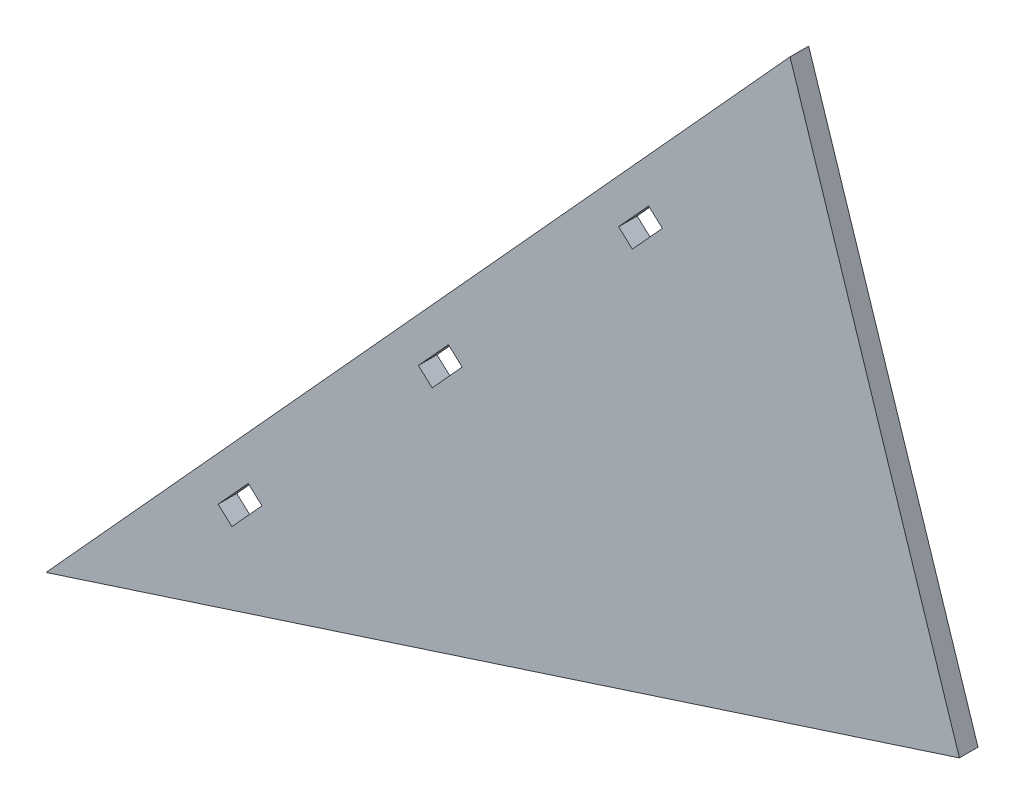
ISO-10303-21;
HEADER;
FILE_DESCRIPTION(('STEP AP214'),'2;1');
FILE_NAME('part.step','',(''),(''),'','','');
FILE_SCHEMA(('AUTOMOTIVE_DESIGN { 1 0 10303 214 1 1 1 1 }'));
ENDSEC;
DATA;
#1=APPLICATION_CONTEXT('core data for automotive mechanical design processes');
#2=APPLICATION_PROTOCOL_DEFINITION('international standard','automotive_design',2000,#1);
#3=PRODUCT_CONTEXT('',#1,'mechanical');
#4=PRODUCT('Part','Part','',(#3));
#5=PRODUCT_RELATED_PRODUCT_CATEGORY('part','',(#4));
#6=PRODUCT_DEFINITION_FORMATION('','',#4);
#7=PRODUCT_DEFINITION_CONTEXT('part definition',#1,'design');
#8=PRODUCT_DEFINITION('design','',#6,#7);
#9=PRODUCT_DEFINITION_SHAPE('','',#8);
#10=(LENGTH_UNIT() NAMED_UNIT(*) SI_UNIT(.MILLI.,.METRE.));
#11=(NAMED_UNIT(*) PLANE_ANGLE_UNIT() SI_UNIT($,.RADIAN.));
#12=(NAMED_UNIT(*) SI_UNIT($,.STERADIAN.) SOLID_ANGLE_UNIT());
#13=UNCERTAINTY_MEASURE_WITH_UNIT(LENGTH_MEASURE(1.E-05),#10,'distance_accuracy_value','');
#14=(GEOMETRIC_REPRESENTATION_CONTEXT(3) GLOBAL_UNCERTAINTY_ASSIGNED_CONTEXT((#13)) GLOBAL_UNIT_ASSIGNED_CONTEXT((#10,
#11,#12)) REPRESENTATION_CONTEXT('',''));
#15=CARTESIAN_POINT('',(0.,0.,0.));
#16=DIRECTION('',(0.,0.,1.));
#17=DIRECTION('',(1.,0.,0.));
#18=AXIS2_PLACEMENT_3D('',#15,#16,#17);
#19=CARTESIAN_POINT('',(0.,0.,2.5));
#20=DIRECTION('',(0.,0.,1.));
#21=DIRECTION('',(1.,0.,0.));
#22=AXIS2_PLACEMENT_3D('',#19,#20,#21);
#23=PLANE('',#22);
#24=DIRECTION('',(0.951274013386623,0.308346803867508,0.));
#25=VECTOR('',#24,1.);
#26=CARTESIAN_POINT('',(121.504022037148,27.0373854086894,2.5));
#27=LINE('',#26,#25);
#28=CARTESIAN_POINT('',(-1.2491354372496,-12.7519321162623,2.5));
#29=VERTEX_POINT('',#28);
#30=CARTESIAN_POINT('',(121.504022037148,27.0373854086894,2.5));
#31=VERTEX_POINT('',#30);
#32=EDGE_CURVE('E240',#29,#31,#27,.T.);
#33=ORIENTED_EDGE('',*,*,#32,.T.);
#34=DIRECTION('',(-0.308346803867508,0.951274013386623,0.));
#35=VECTOR('',#34,1.);
#36=CARTESIAN_POINT('',(98.7437820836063,97.2545063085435,2.5));
#37=LINE('',#36,#35);
#38=CARTESIAN_POINT('',(98.7437820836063,97.2545063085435,2.5));
#39=VERTEX_POINT('',#38);
#40=EDGE_CURVE('E243',#31,#39,#37,.T.);
#41=ORIENTED_EDGE('',*,*,#40,.T.);
#42=DIRECTION('',(-0.672625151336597,-0.739983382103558,0.));
#43=VECTOR('',#42,1.);
#44=CARTESIAN_POINT('',(98.7437820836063,97.2545063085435,2.5));
#45=LINE('',#44,#43);
#46=EDGE_CURVE('E246',#39,#29,#45,.T.);
#47=ORIENTED_EDGE('',*,*,#46,.T.);
#48=EDGE_LOOP('',(#33,#41,#47));
#49=FACE_BOUND('',#48,.T.);
#50=DIRECTION('',(0.672625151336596,0.739983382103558,0.));
#51=VECTOR('',#50,1.);
#52=CARTESIAN_POINT('',(77.5495233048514,64.2741765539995,2.5));
#53=LINE('',#52,#51);
#54=CARTESIAN_POINT('',(77.5495233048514,64.2741765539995,2.5));
#55=VERTEX_POINT('',#54);
#56=CARTESIAN_POINT('',(81.585274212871,68.7140768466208,2.5));
#57=VERTEX_POINT('',#56);
#58=EDGE_CURVE('E211',#55,#57,#53,.T.);
#59=ORIENTED_EDGE('',*,*,#58,.F.);
#60=DIRECTION('',(0.739983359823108,-0.672625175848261,0.));
#61=VECTOR('',#60,1.);
#62=CARTESIAN_POINT('',(75.6995649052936,65.9557394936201,2.5));
#63=LINE('',#62,#61);
#64=CARTESIAN_POINT('',(75.6995649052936,65.9557394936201,2.5));
#65=VERTEX_POINT('',#64);
#66=EDGE_CURVE('E209',#65,#55,#63,.T.);
#67=ORIENTED_EDGE('',*,*,#66,.F.);
#68=DIRECTION('',(-0.672625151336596,-0.739983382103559,0.));
#69=VECTOR('',#68,1.);
#70=CARTESIAN_POINT('',(75.6995649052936,65.9557394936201,2.5));
#71=LINE('',#70,#69);
#72=CARTESIAN_POINT('',(79.7353157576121,70.3956397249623,2.5));
#73=VERTEX_POINT('',#72);
#74=EDGE_CURVE('E217',#73,#65,#71,.T.);
#75=ORIENTED_EDGE('',*,*,#74,.F.);
#76=DIRECTION('',(-0.739983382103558,0.672625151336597,0.));
#77=VECTOR('',#76,1.);
#78=CARTESIAN_POINT('',(79.7353157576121,70.3956397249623,2.5));
#79=LINE('',#78,#77);
#80=EDGE_CURVE('E214',#57,#73,#79,.T.);
#81=ORIENTED_EDGE('',*,*,#80,.F.);
#82=EDGE_LOOP('',(#59,#67,#75,#81));
#83=FACE_BOUND('',#82,.T.);
#84=DIRECTION('',(0.672625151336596,0.739983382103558,0.));
#85=VECTOR('',#84,1.);
#86=CARTESIAN_POINT('',(50.6445171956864,34.674841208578,2.5));
#87=LINE('',#86,#85);
#88=CARTESIAN_POINT('',(50.6445171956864,34.674841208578,2.5));
#89=VERTEX_POINT('',#88);
#90=CARTESIAN_POINT('',(54.680268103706,39.1147415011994,2.5));
#91=VERTEX_POINT('',#90);
#92=EDGE_CURVE('E180',#89,#91,#87,.T.);
#93=ORIENTED_EDGE('',*,*,#92,.F.);
#94=DIRECTION('',(0.739983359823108,-0.672625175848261,0.));
#95=VECTOR('',#94,1.);
#96=CARTESIAN_POINT('',(48.7945587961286,36.3564041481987,2.5));
#97=LINE('',#96,#95);
#98=CARTESIAN_POINT('',(48.7945587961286,36.3564041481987,2.5));
#99=VERTEX_POINT('',#98);
#100=EDGE_CURVE('E178',#99,#89,#97,.T.);
#101=ORIENTED_EDGE('',*,*,#100,.F.);
#102=DIRECTION('',(-0.672625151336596,-0.739983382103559,0.));
#103=VECTOR('',#102,1.);
#104=CARTESIAN_POINT('',(48.7945587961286,36.3564041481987,2.5));
#105=LINE('',#104,#103);
#106=CARTESIAN_POINT('',(52.8303096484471,40.7963043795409,2.5));
#107=VERTEX_POINT('',#106);
#108=EDGE_CURVE('E186',#107,#99,#105,.T.);
#109=ORIENTED_EDGE('',*,*,#108,.F.);
#110=DIRECTION('',(-0.739983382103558,0.672625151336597,0.));
#111=VECTOR('',#110,1.);
#112=CARTESIAN_POINT('',(52.8303096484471,40.7963043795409,2.5));
#113=LINE('',#112,#111);
#114=EDGE_CURVE('E183',#91,#107,#113,.T.);
#115=ORIENTED_EDGE('',*,*,#114,.F.);
#116=EDGE_LOOP('',(#93,#101,#109,#115));
#117=FACE_BOUND('',#116,.T.);
#118=DIRECTION('',(0.672625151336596,0.739983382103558,0.));
#119=VECTOR('',#118,1.);
#120=CARTESIAN_POINT('',(23.7395110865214,5.07550586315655,2.5));
#121=LINE('',#120,#119);
#122=CARTESIAN_POINT('',(23.7395110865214,5.07550586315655,2.5));
#123=VERTEX_POINT('',#122);
#124=CARTESIAN_POINT('',(27.775261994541,9.5154061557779,2.5));
#125=VERTEX_POINT('',#124);
#126=EDGE_CURVE('E150',#123,#125,#121,.T.);
#127=ORIENTED_EDGE('',*,*,#126,.F.);
#128=DIRECTION('',(0.739983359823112,-0.672625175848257,0.));
#129=VECTOR('',#128,1.);
#130=CARTESIAN_POINT('',(21.8895526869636,6.75706880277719,2.5));
#131=LINE('',#130,#129);
#132=CARTESIAN_POINT('',(21.8895526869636,6.75706880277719,2.5));
#133=VERTEX_POINT('',#132);
#134=EDGE_CURVE('E142',#133,#123,#131,.T.);
#135=ORIENTED_EDGE('',*,*,#134,.F.);
#136=DIRECTION('',(-0.672625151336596,-0.739983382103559,0.));
#137=VECTOR('',#136,1.);
#138=CARTESIAN_POINT('',(21.8895526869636,6.75706880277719,2.5));
#139=LINE('',#138,#137);
#140=CARTESIAN_POINT('',(25.9253035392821,11.1969690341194,2.5));
#141=VERTEX_POINT('',#140);
#142=EDGE_CURVE('E164',#141,#133,#139,.T.);
#143=ORIENTED_EDGE('',*,*,#142,.F.);
#144=DIRECTION('',(-0.739983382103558,0.672625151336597,0.));
#145=VECTOR('',#144,1.);
#146=CARTESIAN_POINT('',(25.9253035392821,11.1969690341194,2.5));
#147=LINE('',#146,#145);
#148=EDGE_CURVE('E162',#125,#141,#147,.T.);
#149=ORIENTED_EDGE('',*,*,#148,.F.);
#150=EDGE_LOOP('',(#127,#135,#143,#149));
#151=FACE_BOUND('',#150,.T.);
#152=ADVANCED_FACE('F35',(#49,#83,#117,#151),#23,.T.);
#153=CARTESIAN_POINT('',(0.,0.,0.));
#154=DIRECTION('',(0.,0.,1.));
#155=DIRECTION('',(1.,0.,0.));
#156=AXIS2_PLACEMENT_3D('',#153,#154,#155);
#157=PLANE('',#156);
#158=DIRECTION('',(0.739983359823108,-0.672625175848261,0.));
#159=VECTOR('',#158,1.);
#160=CARTESIAN_POINT('',(48.7945587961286,36.3564041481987,0.));
#161=LINE('',#160,#159);
#162=CARTESIAN_POINT('',(48.7945587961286,36.3564041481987,0.));
#163=VERTEX_POINT('',#162);
#164=CARTESIAN_POINT('',(50.6445171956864,34.674841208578,0.));
#165=VERTEX_POINT('',#164);
#166=EDGE_CURVE('E158',#163,#165,#161,.T.);
#167=ORIENTED_EDGE('',*,*,#166,.T.);
#168=DIRECTION('',(0.672625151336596,0.739983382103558,0.));
#169=VECTOR('',#168,1.);
#170=CARTESIAN_POINT('',(50.6445171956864,34.674841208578,0.));
#171=LINE('',#170,#169);
#172=CARTESIAN_POINT('',(54.680268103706,39.1147415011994,0.));
#173=VERTEX_POINT('',#172);
#174=EDGE_CURVE('E191',#165,#173,#171,.T.);
#175=ORIENTED_EDGE('',*,*,#174,.T.);
#176=DIRECTION('',(-0.739983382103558,0.672625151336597,0.));
#177=VECTOR('',#176,1.);
#178=CARTESIAN_POINT('',(52.8303096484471,40.7963043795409,0.));
#179=LINE('',#178,#177);
#180=CARTESIAN_POINT('',(52.8303096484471,40.7963043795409,0.));
#181=VERTEX_POINT('',#180);
#182=EDGE_CURVE('E194',#173,#181,#179,.T.);
#183=ORIENTED_EDGE('',*,*,#182,.T.);
#184=DIRECTION('',(-0.672625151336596,-0.739983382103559,0.));
#185=VECTOR('',#184,1.);
#186=CARTESIAN_POINT('',(48.7945587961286,36.3564041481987,0.));
#187=LINE('',#186,#185);
#188=EDGE_CURVE('E181',#181,#163,#187,.T.);
#189=ORIENTED_EDGE('',*,*,#188,.T.);
#190=EDGE_LOOP('',(#167,#175,#183,#189));
#191=FACE_BOUND('',#190,.T.);
#192=DIRECTION('',(0.951274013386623,0.308346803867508,0.));
#193=VECTOR('',#192,1.);
#194=CARTESIAN_POINT('',(121.504022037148,27.0373854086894,0.));
#195=LINE('',#194,#193);
#196=CARTESIAN_POINT('',(-1.2491354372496,-12.7519321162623,0.));
#197=VERTEX_POINT('',#196);
#198=CARTESIAN_POINT('',(121.504022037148,27.0373854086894,0.));
#199=VERTEX_POINT('',#198);
#200=EDGE_CURVE('E239',#197,#199,#195,.T.);
#201=ORIENTED_EDGE('',*,*,#200,.F.);
#202=DIRECTION('',(-0.672625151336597,-0.739983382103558,0.));
#203=VECTOR('',#202,1.);
#204=CARTESIAN_POINT('',(98.7437820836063,97.2545063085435,0.));
#205=LINE('',#204,#203);
#206=CARTESIAN_POINT('',(98.7437820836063,97.2545063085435,0.));
#207=VERTEX_POINT('',#206);
#208=EDGE_CURVE('E244',#207,#197,#205,.T.);
#209=ORIENTED_EDGE('',*,*,#208,.F.);
#210=DIRECTION('',(-0.308346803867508,0.951274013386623,0.));
#211=VECTOR('',#210,1.);
#212=CARTESIAN_POINT('',(98.7437820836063,97.2545063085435,0.));
#213=LINE('',#212,#211);
#214=EDGE_CURVE('E251',#199,#207,#213,.T.);
#215=ORIENTED_EDGE('',*,*,#214,.F.);
#216=EDGE_LOOP('',(#201,#209,#215));
#217=FACE_BOUND('',#216,.T.);
#218=DIRECTION('',(0.739983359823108,-0.672625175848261,0.));
#219=VECTOR('',#218,1.);
#220=CARTESIAN_POINT('',(75.6995649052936,65.9557394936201,0.));
#221=LINE('',#220,#219);
#222=CARTESIAN_POINT('',(75.6995649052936,65.9557394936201,0.));
#223=VERTEX_POINT('',#222);
#224=CARTESIAN_POINT('',(77.5495233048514,64.2741765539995,0.));
#225=VERTEX_POINT('',#224);
#226=EDGE_CURVE('E208',#223,#225,#221,.T.);
#227=ORIENTED_EDGE('',*,*,#226,.T.);
#228=DIRECTION('',(0.672625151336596,0.739983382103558,0.));
#229=VECTOR('',#228,1.);
#230=CARTESIAN_POINT('',(77.5495233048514,64.2741765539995,0.));
#231=LINE('',#230,#229);
#232=CARTESIAN_POINT('',(81.585274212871,68.7140768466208,0.));
#233=VERTEX_POINT('',#232);
#234=EDGE_CURVE('E222',#225,#233,#231,.T.);
#235=ORIENTED_EDGE('',*,*,#234,.T.);
#236=DIRECTION('',(-0.739983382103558,0.672625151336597,0.));
#237=VECTOR('',#236,1.);
#238=CARTESIAN_POINT('',(79.7353157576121,70.3956397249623,0.));
#239=LINE('',#238,#237);
#240=CARTESIAN_POINT('',(79.7353157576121,70.3956397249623,0.));
#241=VERTEX_POINT('',#240);
#242=EDGE_CURVE('E225',#233,#241,#239,.T.);
#243=ORIENTED_EDGE('',*,*,#242,.T.);
#244=DIRECTION('',(-0.672625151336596,-0.739983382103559,0.));
#245=VECTOR('',#244,1.);
#246=CARTESIAN_POINT('',(75.6995649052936,65.9557394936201,0.));
#247=LINE('',#246,#245);
#248=EDGE_CURVE('E212',#241,#223,#247,.T.);
#249=ORIENTED_EDGE('',*,*,#248,.T.);
#250=EDGE_LOOP('',(#227,#235,#243,#249));
#251=FACE_BOUND('',#250,.T.);
#252=DIRECTION('',(0.739983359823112,-0.672625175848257,0.));
#253=VECTOR('',#252,1.);
#254=CARTESIAN_POINT('',(21.8895526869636,6.75706880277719,0.));
#255=LINE('',#254,#253);
#256=CARTESIAN_POINT('',(21.8895526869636,6.75706880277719,0.));
#257=VERTEX_POINT('',#256);
#258=CARTESIAN_POINT('',(23.7395110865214,5.07550586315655,0.));
#259=VERTEX_POINT('',#258);
#260=EDGE_CURVE('E58',#257,#259,#255,.T.);
#261=ORIENTED_EDGE('',*,*,#260,.T.);
#262=DIRECTION('',(0.672625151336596,0.739983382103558,0.));
#263=VECTOR('',#262,1.);
#264=CARTESIAN_POINT('',(23.7395110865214,5.07550586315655,0.));
#265=LINE('',#264,#263);
#266=CARTESIAN_POINT('',(27.775261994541,9.5154061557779,0.));
#267=VERTEX_POINT('',#266);
#268=EDGE_CURVE('E157',#259,#267,#265,.T.);
#269=ORIENTED_EDGE('',*,*,#268,.T.);
#270=DIRECTION('',(-0.739983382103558,0.672625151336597,0.));
#271=VECTOR('',#270,1.);
#272=CARTESIAN_POINT('',(25.9253035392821,11.1969690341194,0.));
#273=LINE('',#272,#271);
#274=CARTESIAN_POINT('',(25.9253035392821,11.1969690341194,0.));
#275=VERTEX_POINT('',#274);
#276=EDGE_CURVE('E170',#267,#275,#273,.T.);
#277=ORIENTED_EDGE('',*,*,#276,.T.);
#278=DIRECTION('',(-0.672625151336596,-0.739983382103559,0.));
#279=VECTOR('',#278,1.);
#280=CARTESIAN_POINT('',(21.8895526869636,6.75706880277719,0.));
#281=LINE('',#280,#279);
#282=EDGE_CURVE('E151',#275,#257,#281,.T.);
#283=ORIENTED_EDGE('',*,*,#282,.T.);
#284=EDGE_LOOP('',(#261,#269,#277,#283));
#285=FACE_BOUND('',#284,.T.);
#286=ADVANCED_FACE('F265',(#191,#217,#251,#285),#157,.F.);
#287=CARTESIAN_POINT('',(121.504022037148,27.0373854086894,2.5));
#288=DIRECTION('',(-0.308346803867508,0.951274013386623,0.));
#289=DIRECTION('',(-0.951274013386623,-0.308346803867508,0.));
#290=AXIS2_PLACEMENT_3D('',#287,#288,#289);
#291=PLANE('',#290);
#292=ORIENTED_EDGE('',*,*,#200,.T.);
#293=DIRECTION('',(0.,0.,-1.));
#294=VECTOR('',#293,1.);
#295=CARTESIAN_POINT('',(121.504022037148,27.0373854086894,2.5));
#296=LINE('',#295,#294);
#297=EDGE_CURVE('E11',#31,#199,#296,.T.);
#298=ORIENTED_EDGE('',*,*,#297,.F.);
#299=ORIENTED_EDGE('',*,*,#32,.F.);
#300=DIRECTION('',(0.,0.,-1.));
#301=VECTOR('',#300,1.);
#302=CARTESIAN_POINT('',(-1.2491354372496,-12.7519321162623,2.5));
#303=LINE('',#302,#301);
#304=EDGE_CURVE('E248',#29,#197,#303,.T.);
#305=ORIENTED_EDGE('',*,*,#304,.T.);
#306=EDGE_LOOP('',(#292,#298,#299,#305));
#307=FACE_BOUND('',#306,.T.);
#308=ADVANCED_FACE('F37',(#307),#291,.F.);
#309=CARTESIAN_POINT('',(98.7437820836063,97.2545063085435,2.5));
#310=DIRECTION('',(-0.951274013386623,-0.308346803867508,0.));
#311=DIRECTION('',(0.308346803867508,-0.951274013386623,0.));
#312=AXIS2_PLACEMENT_3D('',#309,#310,#311);
#313=PLANE('',#312);
#314=ORIENTED_EDGE('',*,*,#214,.T.);
#315=DIRECTION('',(0.,0.,-1.));
#316=VECTOR('',#315,1.);
#317=CARTESIAN_POINT('',(98.7437820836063,97.2545063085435,2.5));
#318=LINE('',#317,#316);
#319=EDGE_CURVE('E43',#39,#207,#318,.T.);
#320=ORIENTED_EDGE('',*,*,#319,.F.);
#321=ORIENTED_EDGE('',*,*,#40,.F.);
#322=ORIENTED_EDGE('',*,*,#297,.T.);
#323=EDGE_LOOP('',(#314,#320,#321,#322));
#324=FACE_BOUND('',#323,.T.);
#325=ADVANCED_FACE('F272',(#324),#313,.F.);
#326=CARTESIAN_POINT('',(98.7437820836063,97.2545063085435,2.5));
#327=DIRECTION('',(0.739983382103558,-0.672625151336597,0.));
#328=DIRECTION('',(0.672625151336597,0.739983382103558,0.));
#329=AXIS2_PLACEMENT_3D('',#326,#327,#328);
#330=PLANE('',#329);
#331=ORIENTED_EDGE('',*,*,#208,.T.);
#332=ORIENTED_EDGE('',*,*,#304,.F.);
#333=ORIENTED_EDGE('',*,*,#46,.F.);
#334=ORIENTED_EDGE('',*,*,#319,.T.);
#335=EDGE_LOOP('',(#331,#332,#333,#334));
#336=FACE_BOUND('',#335,.T.);
#337=ADVANCED_FACE('F260',(#336),#330,.F.);
#338=CARTESIAN_POINT('',(75.6995649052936,65.9557394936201,2.5));
#339=DIRECTION('',(0.672625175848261,0.739983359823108,0.));
#340=DIRECTION('',(-0.739983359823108,0.672625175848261,0.));
#341=AXIS2_PLACEMENT_3D('',#338,#339,#340);
#342=PLANE('',#341);
#343=ORIENTED_EDGE('',*,*,#226,.F.);
#344=DIRECTION('',(0.,0.,-1.));
#345=VECTOR('',#344,1.);
#346=CARTESIAN_POINT('',(75.6995649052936,65.9557394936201,2.5));
#347=LINE('',#346,#345);
#348=EDGE_CURVE('E219',#65,#223,#347,.T.);
#349=ORIENTED_EDGE('',*,*,#348,.F.);
#350=ORIENTED_EDGE('',*,*,#66,.T.);
#351=DIRECTION('',(0.,0.,-1.));
#352=VECTOR('',#351,1.);
#353=CARTESIAN_POINT('',(77.5495233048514,64.2741765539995,2.5));
#354=LINE('',#353,#352);
#355=EDGE_CURVE('E236',#55,#225,#354,.T.);
#356=ORIENTED_EDGE('',*,*,#355,.T.);
#357=EDGE_LOOP('',(#343,#349,#350,#356));
#358=FACE_BOUND('',#357,.T.);
#359=ADVANCED_FACE('F278',(#358),#342,.T.);
#360=CARTESIAN_POINT('',(77.5495233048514,64.2741765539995,2.5));
#361=DIRECTION('',(-0.739983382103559,0.672625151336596,0.));
#362=DIRECTION('',(-0.672625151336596,-0.739983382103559,0.));
#363=AXIS2_PLACEMENT_3D('',#360,#361,#362);
#364=PLANE('',#363);
#365=ORIENTED_EDGE('',*,*,#234,.F.);
#366=ORIENTED_EDGE('',*,*,#355,.F.);
#367=ORIENTED_EDGE('',*,*,#58,.T.);
#368=DIRECTION('',(0.,0.,-1.));
#369=VECTOR('',#368,1.);
#370=CARTESIAN_POINT('',(81.585274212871,68.7140768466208,2.5));
#371=LINE('',#370,#369);
#372=EDGE_CURVE('E234',#57,#233,#371,.T.);
#373=ORIENTED_EDGE('',*,*,#372,.T.);
#374=EDGE_LOOP('',(#365,#366,#367,#373));
#375=FACE_BOUND('',#374,.T.);
#376=ADVANCED_FACE('F290',(#375),#364,.T.);
#377=CARTESIAN_POINT('',(79.7353157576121,70.3956397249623,2.5));
#378=DIRECTION('',(-0.672625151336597,-0.739983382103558,0.));
#379=DIRECTION('',(0.739983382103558,-0.672625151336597,0.));
#380=AXIS2_PLACEMENT_3D('',#377,#378,#379);
#381=PLANE('',#380);
#382=ORIENTED_EDGE('',*,*,#242,.F.);
#383=ORIENTED_EDGE('',*,*,#372,.F.);
#384=ORIENTED_EDGE('',*,*,#80,.T.);
#385=DIRECTION('',(0.,0.,-1.));
#386=VECTOR('',#385,1.);
#387=CARTESIAN_POINT('',(79.7353157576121,70.3956397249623,2.5));
#388=LINE('',#387,#386);
#389=EDGE_CURVE('E232',#73,#241,#388,.T.);
#390=ORIENTED_EDGE('',*,*,#389,.T.);
#391=EDGE_LOOP('',(#382,#383,#384,#390));
#392=FACE_BOUND('',#391,.T.);
#393=ADVANCED_FACE('F294',(#392),#381,.T.);
#394=CARTESIAN_POINT('',(75.6995649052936,65.9557394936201,2.5));
#395=DIRECTION('',(0.739983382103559,-0.672625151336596,0.));
#396=DIRECTION('',(0.672625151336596,0.739983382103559,0.));
#397=AXIS2_PLACEMENT_3D('',#394,#395,#396);
#398=PLANE('',#397);
#399=ORIENTED_EDGE('',*,*,#248,.F.);
#400=ORIENTED_EDGE('',*,*,#389,.F.);
#401=ORIENTED_EDGE('',*,*,#74,.T.);
#402=ORIENTED_EDGE('',*,*,#348,.T.);
#403=EDGE_LOOP('',(#399,#400,#401,#402));
#404=FACE_BOUND('',#403,.T.);
#405=ADVANCED_FACE('F298',(#404),#398,.T.);
#406=CARTESIAN_POINT('',(48.7945587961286,36.3564041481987,2.5));
#407=DIRECTION('',(0.672625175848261,0.739983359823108,0.));
#408=DIRECTION('',(-0.739983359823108,0.672625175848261,0.));
#409=AXIS2_PLACEMENT_3D('',#406,#407,#408);
#410=PLANE('',#409);
#411=ORIENTED_EDGE('',*,*,#166,.F.);
#412=DIRECTION('',(0.,0.,-1.));
#413=VECTOR('',#412,1.);
#414=CARTESIAN_POINT('',(48.7945587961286,36.3564041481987,2.5));
#415=LINE('',#414,#413);
#416=EDGE_CURVE('E188',#99,#163,#415,.T.);
#417=ORIENTED_EDGE('',*,*,#416,.F.);
#418=ORIENTED_EDGE('',*,*,#100,.T.);
#419=DIRECTION('',(0.,0.,-1.));
#420=VECTOR('',#419,1.);
#421=CARTESIAN_POINT('',(50.6445171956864,34.674841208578,2.5));
#422=LINE('',#421,#420);
#423=EDGE_CURVE('E205',#89,#165,#422,.T.);
#424=ORIENTED_EDGE('',*,*,#423,.T.);
#425=EDGE_LOOP('',(#411,#417,#418,#424));
#426=FACE_BOUND('',#425,.T.);
#427=ADVANCED_FACE('F302',(#426),#410,.T.);
#428=CARTESIAN_POINT('',(50.6445171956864,34.674841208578,2.5));
#429=DIRECTION('',(-0.739983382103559,0.672625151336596,0.));
#430=DIRECTION('',(-0.672625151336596,-0.739983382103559,0.));
#431=AXIS2_PLACEMENT_3D('',#428,#429,#430);
#432=PLANE('',#431);
#433=ORIENTED_EDGE('',*,*,#174,.F.);
#434=ORIENTED_EDGE('',*,*,#423,.F.);
#435=ORIENTED_EDGE('',*,*,#92,.T.);
#436=DIRECTION('',(0.,0.,-1.));
#437=VECTOR('',#436,1.);
#438=CARTESIAN_POINT('',(54.680268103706,39.1147415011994,2.5));
#439=LINE('',#438,#437);
#440=EDGE_CURVE('E203',#91,#173,#439,.T.);
#441=ORIENTED_EDGE('',*,*,#440,.T.);
#442=EDGE_LOOP('',(#433,#434,#435,#441));
#443=FACE_BOUND('',#442,.T.);
#444=ADVANCED_FACE('F306',(#443),#432,.T.);
#445=CARTESIAN_POINT('',(52.8303096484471,40.7963043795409,2.5));
#446=DIRECTION('',(-0.672625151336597,-0.739983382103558,0.));
#447=DIRECTION('',(0.739983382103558,-0.672625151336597,0.));
#448=AXIS2_PLACEMENT_3D('',#445,#446,#447);
#449=PLANE('',#448);
#450=ORIENTED_EDGE('',*,*,#182,.F.);
#451=ORIENTED_EDGE('',*,*,#440,.F.);
#452=ORIENTED_EDGE('',*,*,#114,.T.);
#453=DIRECTION('',(0.,0.,-1.));
#454=VECTOR('',#453,1.);
#455=CARTESIAN_POINT('',(52.8303096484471,40.7963043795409,2.5));
#456=LINE('',#455,#454);
#457=EDGE_CURVE('E201',#107,#181,#456,.T.);
#458=ORIENTED_EDGE('',*,*,#457,.T.);
#459=EDGE_LOOP('',(#450,#451,#452,#458));
#460=FACE_BOUND('',#459,.T.);
#461=ADVANCED_FACE('F310',(#460),#449,.T.);
#462=CARTESIAN_POINT('',(48.7945587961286,36.3564041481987,2.5));
#463=DIRECTION('',(0.739983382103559,-0.672625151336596,0.));
#464=DIRECTION('',(0.672625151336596,0.739983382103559,0.));
#465=AXIS2_PLACEMENT_3D('',#462,#463,#464);
#466=PLANE('',#465);
#467=ORIENTED_EDGE('',*,*,#188,.F.);
#468=ORIENTED_EDGE('',*,*,#457,.F.);
#469=ORIENTED_EDGE('',*,*,#108,.T.);
#470=ORIENTED_EDGE('',*,*,#416,.T.);
#471=EDGE_LOOP('',(#467,#468,#469,#470));
#472=FACE_BOUND('',#471,.T.);
#473=ADVANCED_FACE('F314',(#472),#466,.T.);
#474=CARTESIAN_POINT('',(21.8895526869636,6.75706880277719,2.5));
#475=DIRECTION('',(0.672625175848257,0.739983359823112,0.));
#476=DIRECTION('',(-0.739983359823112,0.672625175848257,0.));
#477=AXIS2_PLACEMENT_3D('',#474,#475,#476);
#478=PLANE('',#477);
#479=ORIENTED_EDGE('',*,*,#260,.F.);
#480=DIRECTION('',(0.,0.,-1.));
#481=VECTOR('',#480,1.);
#482=CARTESIAN_POINT('',(21.8895526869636,6.75706880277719,2.5));
#483=LINE('',#482,#481);
#484=EDGE_CURVE('E146',#133,#257,#483,.T.);
#485=ORIENTED_EDGE('',*,*,#484,.F.);
#486=ORIENTED_EDGE('',*,*,#134,.T.);
#487=DIRECTION('',(0.,0.,-1.));
#488=VECTOR('',#487,1.);
#489=CARTESIAN_POINT('',(23.7395110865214,5.07550586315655,2.5));
#490=LINE('',#489,#488);
#491=EDGE_CURVE('E145',#123,#259,#490,.T.);
#492=ORIENTED_EDGE('',*,*,#491,.T.);
#493=EDGE_LOOP('',(#479,#485,#486,#492));
#494=FACE_BOUND('',#493,.T.);
#495=ADVANCED_FACE('F144',(#494),#478,.T.);
#496=CARTESIAN_POINT('',(23.7395110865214,5.07550586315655,2.5));
#497=DIRECTION('',(-0.739983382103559,0.672625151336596,0.));
#498=DIRECTION('',(-0.672625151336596,-0.739983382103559,0.));
#499=AXIS2_PLACEMENT_3D('',#496,#497,#498);
#500=PLANE('',#499);
#501=ORIENTED_EDGE('',*,*,#268,.F.);
#502=ORIENTED_EDGE('',*,*,#491,.F.);
#503=ORIENTED_EDGE('',*,*,#126,.T.);
#504=DIRECTION('',(0.,0.,-1.));
#505=VECTOR('',#504,1.);
#506=CARTESIAN_POINT('',(27.775261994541,9.5154061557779,2.5));
#507=LINE('',#506,#505);
#508=EDGE_CURVE('E159',#125,#267,#507,.T.);
#509=ORIENTED_EDGE('',*,*,#508,.T.);
#510=EDGE_LOOP('',(#501,#502,#503,#509));
#511=FACE_BOUND('',#510,.T.);
#512=ADVANCED_FACE('F154',(#511),#500,.T.);
#513=CARTESIAN_POINT('',(25.9253035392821,11.1969690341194,2.5));
#514=DIRECTION('',(-0.672625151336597,-0.739983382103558,0.));
#515=DIRECTION('',(0.739983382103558,-0.672625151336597,0.));
#516=AXIS2_PLACEMENT_3D('',#513,#514,#515);
#517=PLANE('',#516);
#518=ORIENTED_EDGE('',*,*,#276,.F.);
#519=ORIENTED_EDGE('',*,*,#508,.F.);
#520=ORIENTED_EDGE('',*,*,#148,.T.);
#521=DIRECTION('',(0.,0.,-1.));
#522=VECTOR('',#521,1.);
#523=CARTESIAN_POINT('',(25.9253035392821,11.1969690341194,2.5));
#524=LINE('',#523,#522);
#525=EDGE_CURVE('E50',#141,#275,#524,.T.);
#526=ORIENTED_EDGE('',*,*,#525,.T.);
#527=EDGE_LOOP('',(#518,#519,#520,#526));
#528=FACE_BOUND('',#527,.T.);
#529=ADVANCED_FACE('F323',(#528),#517,.T.);
#530=CARTESIAN_POINT('',(21.8895526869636,6.75706880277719,2.5));
#531=DIRECTION('',(0.739983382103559,-0.672625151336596,0.));
#532=DIRECTION('',(0.672625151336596,0.739983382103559,0.));
#533=AXIS2_PLACEMENT_3D('',#530,#531,#532);
#534=PLANE('',#533);
#535=ORIENTED_EDGE('',*,*,#282,.F.);
#536=ORIENTED_EDGE('',*,*,#525,.F.);
#537=ORIENTED_EDGE('',*,*,#142,.T.);
#538=ORIENTED_EDGE('',*,*,#484,.T.);
#539=EDGE_LOOP('',(#535,#536,#537,#538));
#540=FACE_BOUND('',#539,.T.);
#541=ADVANCED_FACE('F326',(#540),#534,.T.);
#542=CLOSED_SHELL('',(#152,#286,#308,#325,#337,#359,#376,#393,#405,#427,#444,#461,#473,#495,
#512,#529,#541));
#543=MANIFOLD_SOLID_BREP('B2',#542);
#544=ADVANCED_BREP_SHAPE_REPRESENTATION('',(#18,#543),#14);
#545=SHAPE_DEFINITION_REPRESENTATION(#9,#544);
ENDSEC;
END-ISO-10303-21;
